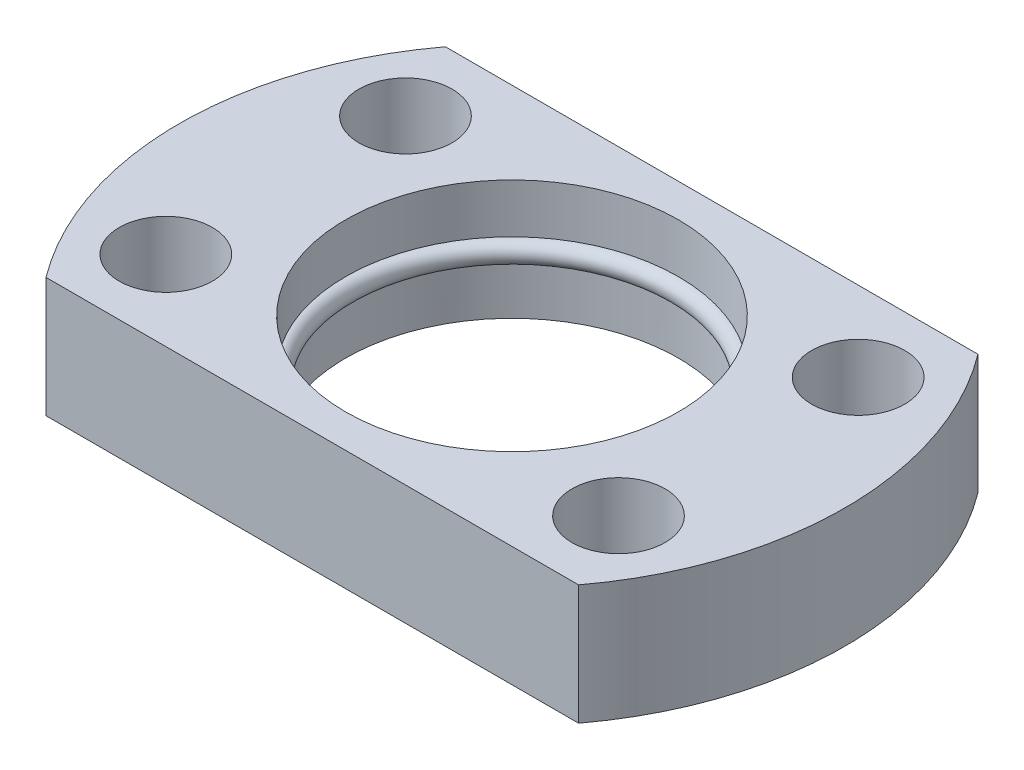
from build123d import *

# Parameters (mm, degrees)
SKETCH1_R           = 12.5
SKETCH1_R_2         = 3.5
BOSS_EXTRUDE1_DEPTH = 4.5
SKETCH2_R           = 0.8


with BuildPart() as part:
    # Sketch1 → Boss-Extrude1 (new, symmetric)
    with BuildSketch(Plane(origin=(0, 0, 0), x_dir=(1, 0, 0), z_dir=(0, 1, 0))):
        with BuildLine():
            Line((-20, 15), (20, 15))
            ThreePointArc((20, 15), (25, 0), (20, -15))
            Line((20, -15), (-20, -15))
            ThreePointArc((-20, -15), (-25, 0), (-20, 15))
        make_face()
        with Locations(Location((0, 0, 0), (0, 0, 270))):
            Circle(SKETCH1_R, mode=Mode.SUBTRACT)
        with Locations(Location((-17, 9, 0), (0, 0, 270))):
            Circle(SKETCH1_R_2, mode=Mode.SUBTRACT)
        with Locations(Location((-17, -9, 0), (0, 0, 270))):
            Circle(SKETCH1_R_2, mode=Mode.SUBTRACT)
        with Locations(Location((17, -9, 0), (0, 0, 270))):
            Circle(SKETCH1_R_2, mode=Mode.SUBTRACT)
        with Locations(Location((17, 9, 0), (0, 0, 270))):
            Circle(SKETCH1_R_2, mode=Mode.SUBTRACT)
    extrude(amount=BOSS_EXTRUDE1_DEPTH, both=True)

    # Sketch2 → Revolve1 (revolve)
    with BuildSketch(Plane.XY, mode=Mode.PRIVATE) as revolve1_sk:
        with Locations((-12.5, 0)):
            Circle(SKETCH2_R)
    revolve(revolve1_sk.sketch.rotate(Axis((0, 0, 0), (0, 1, 0)), 270), axis=Axis((0, 0, 0), (0, 1, 0)))


solid = part.part
